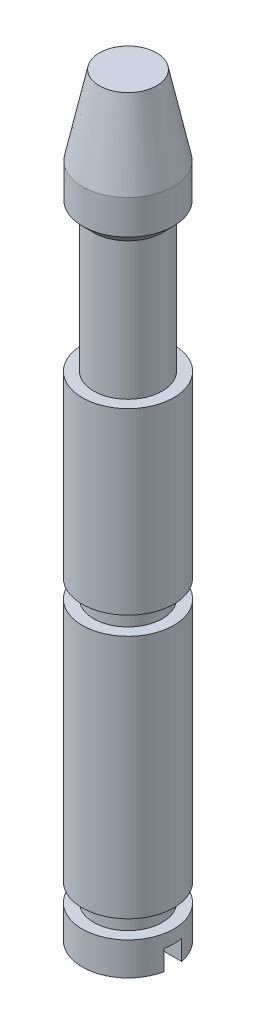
ISO-10303-21;
HEADER;
FILE_DESCRIPTION(('STEP AP214'),'2;1');
FILE_NAME('part.step','',(''),(''),'','','');
FILE_SCHEMA(('AUTOMOTIVE_DESIGN { 1 0 10303 214 1 1 1 1 }'));
ENDSEC;
DATA;
#1=APPLICATION_CONTEXT('core data for automotive mechanical design processes');
#2=APPLICATION_PROTOCOL_DEFINITION('international standard','automotive_design',2000,#1);
#3=PRODUCT_CONTEXT('',#1,'mechanical');
#4=PRODUCT('Part','Part','',(#3));
#5=PRODUCT_RELATED_PRODUCT_CATEGORY('part','',(#4));
#6=PRODUCT_DEFINITION_FORMATION('','',#4);
#7=PRODUCT_DEFINITION_CONTEXT('part definition',#1,'design');
#8=PRODUCT_DEFINITION('design','',#6,#7);
#9=PRODUCT_DEFINITION_SHAPE('','',#8);
#10=(LENGTH_UNIT() NAMED_UNIT(*) SI_UNIT(.MILLI.,.METRE.));
#11=(NAMED_UNIT(*) PLANE_ANGLE_UNIT() SI_UNIT($,.RADIAN.));
#12=(NAMED_UNIT(*) SI_UNIT($,.STERADIAN.) SOLID_ANGLE_UNIT());
#13=UNCERTAINTY_MEASURE_WITH_UNIT(LENGTH_MEASURE(1.E-05),#10,'distance_accuracy_value','');
#14=(GEOMETRIC_REPRESENTATION_CONTEXT(3) GLOBAL_UNCERTAINTY_ASSIGNED_CONTEXT((#13)) GLOBAL_UNIT_ASSIGNED_CONTEXT((#10,
#11,#12)) REPRESENTATION_CONTEXT('',''));
#15=CARTESIAN_POINT('',(0.,0.,0.));
#16=DIRECTION('',(0.,0.,1.));
#17=DIRECTION('',(1.,0.,0.));
#18=AXIS2_PLACEMENT_3D('',#15,#16,#17);
#19=CARTESIAN_POINT('',(3.175,0.,0.));
#20=DIRECTION('',(0.,-1.,0.));
#21=DIRECTION('',(0.,0.,-1.));
#22=AXIS2_PLACEMENT_3D('',#19,#20,#21);
#23=PLANE('',#22);
#24=DIRECTION('',(-1.,0.,0.));
#25=VECTOR('',#24,1.);
#26=CARTESIAN_POINT('',(3.175,0.,0.6096));
#27=LINE('',#26,#25);
#28=CARTESIAN_POINT('',(3.11592888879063,0.,0.6096));
#29=VERTEX_POINT('',#28);
#30=CARTESIAN_POINT('',(-3.11592888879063,0.,0.6096));
#31=VERTEX_POINT('',#30);
#32=EDGE_CURVE('E88',#29,#31,#27,.T.);
#33=ORIENTED_EDGE('',*,*,#32,.F.);
#34=CARTESIAN_POINT('',(0.,0.,0.));
#35=DIRECTION('',(0.,-1.,0.));
#36=DIRECTION('',(0.,0.,-1.));
#37=AXIS2_PLACEMENT_3D('',#34,#35,#36);
#38=CIRCLE('',#37,3.175);
#39=EDGE_CURVE('E100',#29,#31,#38,.T.);
#40=ORIENTED_EDGE('',*,*,#39,.T.);
#41=EDGE_LOOP('',(#33,#40));
#42=FACE_BOUND('',#41,.T.);
#43=ADVANCED_FACE('F40',(#42),#23,.T.);
#44=CARTESIAN_POINT('',(0.,52.3875,0.));
#45=DIRECTION('',(0.,1.,0.));
#46=DIRECTION('',(0.,0.,1.));
#47=AXIS2_PLACEMENT_3D('',#44,#45,#46);
#48=PLANE('',#47);
#49=CARTESIAN_POINT('',(0.,52.3875,0.));
#50=DIRECTION('',(0.,-1.,0.));
#51=DIRECTION('',(0.,0.,-1.));
#52=AXIS2_PLACEMENT_3D('',#49,#50,#51);
#53=CIRCLE('',#52,1.984375);
#54=CARTESIAN_POINT('',(0.,52.3875,-1.984375));
#55=VERTEX_POINT('',#54);
#56=EDGE_CURVE('E89',#55,#55,#53,.T.);
#57=ORIENTED_EDGE('',*,*,#56,.F.);
#58=EDGE_LOOP('',(#57));
#59=FACE_BOUND('',#58,.T.);
#60=ADVANCED_FACE('F42',(#59),#48,.T.);
#61=CARTESIAN_POINT('',(0.,46.9055473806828,0.));
#62=DIRECTION('',(0.,-1.,0.));
#63=DIRECTION('',(0.,0.,-1.));
#64=AXIS2_PLACEMENT_3D('',#61,#62,#63);
#65=CONICAL_SURFACE('',#64,3.1496,0.209439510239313);
#66=ORIENTED_EDGE('',*,*,#56,.T.);
#67=EDGE_LOOP('',(#66));
#68=FACE_BOUND('',#67,.T.);
#69=CARTESIAN_POINT('',(0.,46.9055473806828,0.));
#70=DIRECTION('',(0.,-1.,0.));
#71=DIRECTION('',(0.,0.,-1.));
#72=AXIS2_PLACEMENT_3D('',#69,#70,#71);
#73=CIRCLE('',#72,3.1496);
#74=CARTESIAN_POINT('',(0.,46.9055473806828,-3.1496));
#75=VERTEX_POINT('',#74);
#76=EDGE_CURVE('E142',#75,#75,#73,.T.);
#77=ORIENTED_EDGE('',*,*,#76,.F.);
#78=EDGE_LOOP('',(#77));
#79=FACE_BOUND('',#78,.T.);
#80=ADVANCED_FACE('F155',(#68,#79),#65,.T.);
#81=CARTESIAN_POINT('',(0.,52.3875,0.));
#82=DIRECTION('',(0.,-1.,0.));
#83=DIRECTION('',(0.,0.,-1.));
#84=AXIS2_PLACEMENT_3D('',#81,#82,#83);
#85=CYLINDRICAL_SURFACE('',#84,3.1496);
#86=ORIENTED_EDGE('',*,*,#76,.T.);
#87=EDGE_LOOP('',(#86));
#88=FACE_BOUND('',#87,.T.);
#89=CARTESIAN_POINT('',(0.,44.5242973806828,0.));
#90=DIRECTION('',(0.,-1.,0.));
#91=DIRECTION('',(0.,0.,-1.));
#92=AXIS2_PLACEMENT_3D('',#89,#90,#91);
#93=CIRCLE('',#92,3.1496);
#94=CARTESIAN_POINT('',(0.,44.5242973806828,-3.1496));
#95=VERTEX_POINT('',#94);
#96=EDGE_CURVE('E139',#95,#95,#93,.T.);
#97=ORIENTED_EDGE('',*,*,#96,.F.);
#98=EDGE_LOOP('',(#97));
#99=FACE_BOUND('',#98,.T.);
#100=ADVANCED_FACE('F211',(#88,#99),#85,.T.);
#101=CARTESIAN_POINT('',(0.,43.7559473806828,0.));
#102=DIRECTION('',(0.,1.,0.));
#103=DIRECTION('',(0.,0.,1.));
#104=AXIS2_PLACEMENT_3D('',#101,#102,#103);
#105=CONICAL_SURFACE('',#104,2.38125,0.785398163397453);
#106=ORIENTED_EDGE('',*,*,#96,.T.);
#107=EDGE_LOOP('',(#106));
#108=FACE_BOUND('',#107,.T.);
#109=CARTESIAN_POINT('',(0.,43.7559473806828,0.));
#110=DIRECTION('',(0.,-1.,0.));
#111=DIRECTION('',(0.,0.,-1.));
#112=AXIS2_PLACEMENT_3D('',#109,#110,#111);
#113=CIRCLE('',#112,2.38125);
#114=CARTESIAN_POINT('',(0.,43.7559473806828,-2.38125));
#115=VERTEX_POINT('',#114);
#116=EDGE_CURVE('E136',#115,#115,#113,.T.);
#117=ORIENTED_EDGE('',*,*,#116,.F.);
#118=EDGE_LOOP('',(#117));
#119=FACE_BOUND('',#118,.T.);
#120=ADVANCED_FACE('F207',(#108,#119),#105,.T.);
#121=CARTESIAN_POINT('',(0.,52.3875,0.));
#122=DIRECTION('',(0.,-1.,0.));
#123=DIRECTION('',(0.,0.,-1.));
#124=AXIS2_PLACEMENT_3D('',#121,#122,#123);
#125=CYLINDRICAL_SURFACE('',#124,2.38125);
#126=ORIENTED_EDGE('',*,*,#116,.T.);
#127=EDGE_LOOP('',(#126));
#128=FACE_BOUND('',#127,.T.);
#129=CARTESIAN_POINT('',(0.,34.2309473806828,0.));
#130=DIRECTION('',(0.,-1.,0.));
#131=DIRECTION('',(0.,0.,-1.));
#132=AXIS2_PLACEMENT_3D('',#129,#130,#131);
#133=CIRCLE('',#132,2.38125);
#134=CARTESIAN_POINT('',(0.,34.2309473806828,-2.38125));
#135=VERTEX_POINT('',#134);
#136=EDGE_CURVE('E133',#135,#135,#133,.T.);
#137=ORIENTED_EDGE('',*,*,#136,.F.);
#138=EDGE_LOOP('',(#137));
#139=FACE_BOUND('',#138,.T.);
#140=ADVANCED_FACE('F203',(#128,#139),#125,.T.);
#141=CARTESIAN_POINT('',(2.38125,34.2309473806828,0.));
#142=DIRECTION('',(0.,1.,0.));
#143=DIRECTION('',(0.,0.,1.));
#144=AXIS2_PLACEMENT_3D('',#141,#142,#143);
#145=PLANE('',#144);
#146=ORIENTED_EDGE('',*,*,#136,.T.);
#147=EDGE_LOOP('',(#146));
#148=FACE_BOUND('',#147,.T.);
#149=CARTESIAN_POINT('',(0.,34.2309473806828,0.));
#150=DIRECTION('',(0.,-1.,0.));
#151=DIRECTION('',(0.,0.,-1.));
#152=AXIS2_PLACEMENT_3D('',#149,#150,#151);
#153=CIRCLE('',#152,3.175);
#154=CARTESIAN_POINT('',(0.,34.2309473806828,-3.175));
#155=VERTEX_POINT('',#154);
#156=EDGE_CURVE('E130',#155,#155,#153,.T.);
#157=ORIENTED_EDGE('',*,*,#156,.F.);
#158=EDGE_LOOP('',(#157));
#159=FACE_BOUND('',#158,.T.);
#160=ADVANCED_FACE('F199',(#148,#159),#145,.T.);
#161=CARTESIAN_POINT('',(0.,52.3875,0.));
#162=DIRECTION('',(0.,-1.,0.));
#163=DIRECTION('',(0.,0.,-1.));
#164=AXIS2_PLACEMENT_3D('',#161,#162,#163);
#165=CYLINDRICAL_SURFACE('',#164,3.175);
#166=ORIENTED_EDGE('',*,*,#156,.T.);
#167=EDGE_LOOP('',(#166));
#168=FACE_BOUND('',#167,.T.);
#169=CARTESIAN_POINT('',(0.,21.81225,0.));
#170=DIRECTION('',(0.,-1.,0.));
#171=DIRECTION('',(0.,0.,-1.));
#172=AXIS2_PLACEMENT_3D('',#169,#170,#171);
#173=CIRCLE('',#172,3.175);
#174=CARTESIAN_POINT('',(0.,21.81225,-3.175));
#175=VERTEX_POINT('',#174);
#176=EDGE_CURVE('E127',#175,#175,#173,.T.);
#177=ORIENTED_EDGE('',*,*,#176,.F.);
#178=EDGE_LOOP('',(#177));
#179=FACE_BOUND('',#178,.T.);
#180=ADVANCED_FACE('F195',(#168,#179),#165,.T.);
#181=CARTESIAN_POINT('',(3.175,21.81225,0.));
#182=DIRECTION('',(0.,-1.,0.));
#183=DIRECTION('',(0.,0.,-1.));
#184=AXIS2_PLACEMENT_3D('',#181,#182,#183);
#185=PLANE('',#184);
#186=ORIENTED_EDGE('',*,*,#176,.T.);
#187=EDGE_LOOP('',(#186));
#188=FACE_BOUND('',#187,.T.);
#189=CARTESIAN_POINT('',(0.,21.81225,0.));
#190=DIRECTION('',(0.,-1.,0.));
#191=DIRECTION('',(0.,0.,-1.));
#192=AXIS2_PLACEMENT_3D('',#189,#190,#191);
#193=CIRCLE('',#192,2.38125);
#194=CARTESIAN_POINT('',(0.,21.81225,-2.38125));
#195=VERTEX_POINT('',#194);
#196=EDGE_CURVE('E124',#195,#195,#193,.T.);
#197=ORIENTED_EDGE('',*,*,#196,.F.);
#198=EDGE_LOOP('',(#197));
#199=FACE_BOUND('',#198,.T.);
#200=ADVANCED_FACE('F191',(#188,#199),#185,.T.);
#201=CARTESIAN_POINT('',(0.,52.3875,0.));
#202=DIRECTION('',(0.,-1.,0.));
#203=DIRECTION('',(0.,0.,-1.));
#204=AXIS2_PLACEMENT_3D('',#201,#202,#203);
#205=CYLINDRICAL_SURFACE('',#204,2.38125);
#206=ORIENTED_EDGE('',*,*,#196,.T.);
#207=EDGE_LOOP('',(#206));
#208=FACE_BOUND('',#207,.T.);
#209=CARTESIAN_POINT('',(0.,20.54225,0.));
#210=DIRECTION('',(0.,-1.,0.));
#211=DIRECTION('',(0.,0.,-1.));
#212=AXIS2_PLACEMENT_3D('',#209,#210,#211);
#213=CIRCLE('',#212,2.38125);
#214=CARTESIAN_POINT('',(0.,20.54225,-2.38125));
#215=VERTEX_POINT('',#214);
#216=EDGE_CURVE('E121',#215,#215,#213,.T.);
#217=ORIENTED_EDGE('',*,*,#216,.F.);
#218=EDGE_LOOP('',(#217));
#219=FACE_BOUND('',#218,.T.);
#220=ADVANCED_FACE('F187',(#208,#219),#205,.T.);
#221=CARTESIAN_POINT('',(3.175,20.54225,0.));
#222=DIRECTION('',(0.,1.,0.));
#223=DIRECTION('',(0.,0.,1.));
#224=AXIS2_PLACEMENT_3D('',#221,#222,#223);
#225=PLANE('',#224);
#226=ORIENTED_EDGE('',*,*,#216,.T.);
#227=EDGE_LOOP('',(#226));
#228=FACE_BOUND('',#227,.T.);
#229=CARTESIAN_POINT('',(0.,20.54225,0.));
#230=DIRECTION('',(0.,-1.,0.));
#231=DIRECTION('',(0.,0.,-1.));
#232=AXIS2_PLACEMENT_3D('',#229,#230,#231);
#233=CIRCLE('',#232,3.175);
#234=CARTESIAN_POINT('',(0.,20.54225,-3.175));
#235=VERTEX_POINT('',#234);
#236=EDGE_CURVE('E118',#235,#235,#233,.T.);
#237=ORIENTED_EDGE('',*,*,#236,.F.);
#238=EDGE_LOOP('',(#237));
#239=FACE_BOUND('',#238,.T.);
#240=ADVANCED_FACE('F183',(#228,#239),#225,.T.);
#241=CARTESIAN_POINT('',(0.,52.3875,0.));
#242=DIRECTION('',(0.,-1.,0.));
#243=DIRECTION('',(0.,0.,-1.));
#244=AXIS2_PLACEMENT_3D('',#241,#242,#243);
#245=CYLINDRICAL_SURFACE('',#244,3.175);
#246=ORIENTED_EDGE('',*,*,#236,.T.);
#247=EDGE_LOOP('',(#246));
#248=FACE_BOUND('',#247,.T.);
#249=CARTESIAN_POINT('',(0.,3.556,0.));
#250=DIRECTION('',(0.,-1.,0.));
#251=DIRECTION('',(0.,0.,-1.));
#252=AXIS2_PLACEMENT_3D('',#249,#250,#251);
#253=CIRCLE('',#252,3.175);
#254=CARTESIAN_POINT('',(0.,3.556,-3.175));
#255=VERTEX_POINT('',#254);
#256=EDGE_CURVE('E115',#255,#255,#253,.T.);
#257=ORIENTED_EDGE('',*,*,#256,.F.);
#258=EDGE_LOOP('',(#257));
#259=FACE_BOUND('',#258,.T.);
#260=ADVANCED_FACE('F179',(#248,#259),#245,.T.);
#261=CARTESIAN_POINT('',(3.175,3.556,0.));
#262=DIRECTION('',(0.,-1.,0.));
#263=DIRECTION('',(0.,0.,-1.));
#264=AXIS2_PLACEMENT_3D('',#261,#262,#263);
#265=PLANE('',#264);
#266=ORIENTED_EDGE('',*,*,#256,.T.);
#267=EDGE_LOOP('',(#266));
#268=FACE_BOUND('',#267,.T.);
#269=CARTESIAN_POINT('',(0.,3.556,0.));
#270=DIRECTION('',(0.,-1.,0.));
#271=DIRECTION('',(0.,0.,-1.));
#272=AXIS2_PLACEMENT_3D('',#269,#270,#271);
#273=CIRCLE('',#272,2.38125);
#274=CARTESIAN_POINT('',(0.,3.556,-2.38125));
#275=VERTEX_POINT('',#274);
#276=EDGE_CURVE('E112',#275,#275,#273,.T.);
#277=ORIENTED_EDGE('',*,*,#276,.F.);
#278=EDGE_LOOP('',(#277));
#279=FACE_BOUND('',#278,.T.);
#280=ADVANCED_FACE('F175',(#268,#279),#265,.T.);
#281=CARTESIAN_POINT('',(0.,52.3875,0.));
#282=DIRECTION('',(0.,-1.,0.));
#283=DIRECTION('',(0.,0.,-1.));
#284=AXIS2_PLACEMENT_3D('',#281,#282,#283);
#285=CYLINDRICAL_SURFACE('',#284,2.38125);
#286=ORIENTED_EDGE('',*,*,#276,.T.);
#287=EDGE_LOOP('',(#286));
#288=FACE_BOUND('',#287,.T.);
#289=CARTESIAN_POINT('',(0.,2.286,0.));
#290=DIRECTION('',(0.,-1.,0.));
#291=DIRECTION('',(0.,0.,-1.));
#292=AXIS2_PLACEMENT_3D('',#289,#290,#291);
#293=CIRCLE('',#292,2.38125);
#294=CARTESIAN_POINT('',(0.,2.286,-2.38125));
#295=VERTEX_POINT('',#294);
#296=EDGE_CURVE('E109',#295,#295,#293,.T.);
#297=ORIENTED_EDGE('',*,*,#296,.F.);
#298=EDGE_LOOP('',(#297));
#299=FACE_BOUND('',#298,.T.);
#300=ADVANCED_FACE('F169',(#288,#299),#285,.T.);
#301=CARTESIAN_POINT('',(3.175,2.286,0.));
#302=DIRECTION('',(0.,1.,0.));
#303=DIRECTION('',(0.,0.,1.));
#304=AXIS2_PLACEMENT_3D('',#301,#302,#303);
#305=PLANE('',#304);
#306=ORIENTED_EDGE('',*,*,#296,.T.);
#307=EDGE_LOOP('',(#306));
#308=FACE_BOUND('',#307,.T.);
#309=CARTESIAN_POINT('',(0.,2.286,0.));
#310=DIRECTION('',(0.,-1.,0.));
#311=DIRECTION('',(0.,0.,-1.));
#312=AXIS2_PLACEMENT_3D('',#309,#310,#311);
#313=CIRCLE('',#312,3.175);
#314=CARTESIAN_POINT('',(0.,2.286,-3.175));
#315=VERTEX_POINT('',#314);
#316=EDGE_CURVE('E103',#315,#315,#313,.T.);
#317=ORIENTED_EDGE('',*,*,#316,.F.);
#318=EDGE_LOOP('',(#317));
#319=FACE_BOUND('',#318,.T.);
#320=ADVANCED_FACE('F165',(#308,#319),#305,.T.);
#321=CARTESIAN_POINT('',(0.,52.3875,0.));
#322=DIRECTION('',(0.,-1.,0.));
#323=DIRECTION('',(0.,0.,-1.));
#324=AXIS2_PLACEMENT_3D('',#321,#322,#323);
#325=CYLINDRICAL_SURFACE('',#324,3.175);
#326=DIRECTION('',(0.,-1.,0.));
#327=VECTOR('',#326,1.);
#328=CARTESIAN_POINT('',(-3.11592888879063,52.3875,0.6096));
#329=LINE('',#328,#327);
#330=CARTESIAN_POINT('',(-3.11592888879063,1.397,0.6096));
#331=VERTEX_POINT('',#330);
#332=EDGE_CURVE('E63',#31,#331,#329,.F.);
#333=ORIENTED_EDGE('',*,*,#332,.F.);
#334=ORIENTED_EDGE('',*,*,#39,.F.);
#335=DIRECTION('',(0.,-1.,0.));
#336=VECTOR('',#335,1.);
#337=CARTESIAN_POINT('',(3.11592888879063,52.3875,0.6096));
#338=LINE('',#337,#336);
#339=CARTESIAN_POINT('',(3.11592888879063,1.397,0.6096));
#340=VERTEX_POINT('',#339);
#341=EDGE_CURVE('E97',#340,#29,#338,.T.);
#342=ORIENTED_EDGE('',*,*,#341,.F.);
#343=CARTESIAN_POINT('',(0.,1.397,0.));
#344=DIRECTION('',(0.,-1.,0.));
#345=DIRECTION('',(0.,0.,-1.));
#346=AXIS2_PLACEMENT_3D('',#343,#344,#345);
#347=CIRCLE('',#346,3.175);
#348=CARTESIAN_POINT('',(3.11592888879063,1.397,-0.6096));
#349=VERTEX_POINT('',#348);
#350=EDGE_CURVE('E44',#340,#349,#347,.F.);
#351=ORIENTED_EDGE('',*,*,#350,.T.);
#352=DIRECTION('',(0.,-1.,0.));
#353=VECTOR('',#352,1.);
#354=CARTESIAN_POINT('',(3.11592888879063,52.3875,-0.6096));
#355=LINE('',#354,#353);
#356=CARTESIAN_POINT('',(3.11592888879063,0.,-0.6096));
#357=VERTEX_POINT('',#356);
#358=EDGE_CURVE('E83',#357,#349,#355,.F.);
#359=ORIENTED_EDGE('',*,*,#358,.F.);
#360=CARTESIAN_POINT('',(-3.11592888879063,0.,-0.6096));
#361=VERTEX_POINT('',#360);
#362=EDGE_CURVE('E95',#361,#357,#38,.T.);
#363=ORIENTED_EDGE('',*,*,#362,.F.);
#364=DIRECTION('',(0.,-1.,0.));
#365=VECTOR('',#364,1.);
#366=CARTESIAN_POINT('',(-3.11592888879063,52.3875,-0.6096));
#367=LINE('',#366,#365);
#368=CARTESIAN_POINT('',(-3.11592888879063,1.397,-0.6096));
#369=VERTEX_POINT('',#368);
#370=EDGE_CURVE('E55',#369,#361,#367,.T.);
#371=ORIENTED_EDGE('',*,*,#370,.F.);
#372=EDGE_CURVE('E12',#369,#331,#347,.F.);
#373=ORIENTED_EDGE('',*,*,#372,.T.);
#374=EDGE_LOOP('',(#333,#334,#342,#351,#359,#363,#371,#373));
#375=FACE_BOUND('',#374,.T.);
#376=ORIENTED_EDGE('',*,*,#316,.T.);
#377=EDGE_LOOP('',(#376));
#378=FACE_BOUND('',#377,.T.);
#379=ADVANCED_FACE('F93',(#375,#378),#325,.T.);
#380=DIRECTION('',(1.,0.,0.));
#381=VECTOR('',#380,1.);
#382=CARTESIAN_POINT('',(3.175,0.,-0.6096));
#383=LINE('',#382,#381);
#384=EDGE_CURVE('E80',#361,#357,#383,.T.);
#385=ORIENTED_EDGE('',*,*,#384,.F.);
#386=ORIENTED_EDGE('',*,*,#362,.T.);
#387=EDGE_LOOP('',(#385,#386));
#388=FACE_BOUND('',#387,.T.);
#389=ADVANCED_FACE('F99',(#388),#23,.T.);
#390=CARTESIAN_POINT('',(-3.175,1.397,0.6096));
#391=DIRECTION('',(0.,0.,1.));
#392=DIRECTION('',(1.,0.,0.));
#393=AXIS2_PLACEMENT_3D('',#390,#391,#392);
#394=PLANE('',#393);
#395=ORIENTED_EDGE('',*,*,#332,.T.);
#396=DIRECTION('',(-1.,0.,0.));
#397=VECTOR('',#396,1.);
#398=CARTESIAN_POINT('',(-3.175,1.397,0.6096));
#399=LINE('',#398,#397);
#400=EDGE_CURVE('E337',#340,#331,#399,.T.);
#401=ORIENTED_EDGE('',*,*,#400,.F.);
#402=ORIENTED_EDGE('',*,*,#341,.T.);
#403=ORIENTED_EDGE('',*,*,#32,.T.);
#404=EDGE_LOOP('',(#395,#401,#402,#403));
#405=FACE_BOUND('',#404,.T.);
#406=ADVANCED_FACE('F147',(#405),#394,.F.);
#407=CARTESIAN_POINT('',(-3.175,1.397,-0.6096));
#408=DIRECTION('',(0.,0.,-1.));
#409=DIRECTION('',(-1.,0.,0.));
#410=AXIS2_PLACEMENT_3D('',#407,#408,#409);
#411=PLANE('',#410);
#412=ORIENTED_EDGE('',*,*,#358,.T.);
#413=DIRECTION('',(1.,0.,0.));
#414=VECTOR('',#413,1.);
#415=CARTESIAN_POINT('',(-3.175,1.397,-0.6096));
#416=LINE('',#415,#414);
#417=EDGE_CURVE('E336',#369,#349,#416,.T.);
#418=ORIENTED_EDGE('',*,*,#417,.F.);
#419=ORIENTED_EDGE('',*,*,#370,.T.);
#420=ORIENTED_EDGE('',*,*,#384,.T.);
#421=EDGE_LOOP('',(#412,#418,#419,#420));
#422=FACE_BOUND('',#421,.T.);
#423=ADVANCED_FACE('F82',(#422),#411,.F.);
#424=CARTESIAN_POINT('',(-3.175,1.397,-0.6096));
#425=DIRECTION('',(0.,-1.,0.));
#426=DIRECTION('',(0.,0.,-1.));
#427=AXIS2_PLACEMENT_3D('',#424,#425,#426);
#428=PLANE('',#427);
#429=ORIENTED_EDGE('',*,*,#417,.T.);
#430=ORIENTED_EDGE('',*,*,#350,.F.);
#431=ORIENTED_EDGE('',*,*,#400,.T.);
#432=ORIENTED_EDGE('',*,*,#372,.F.);
#433=EDGE_LOOP('',(#429,#430,#431,#432));
#434=FACE_BOUND('',#433,.T.);
#435=ADVANCED_FACE('F324',(#434),#428,.T.);
#436=CLOSED_SHELL('',(#43,#60,#80,#100,#120,#140,#160,#180,#200,#220,#240,#260,#280,#300,#320,
#379,#389,#406,#423,#435));
#437=MANIFOLD_SOLID_BREP('B2',#436);
#438=ADVANCED_BREP_SHAPE_REPRESENTATION('',(#18,#437),#14);
#439=SHAPE_DEFINITION_REPRESENTATION(#9,#438);
ENDSEC;
END-ISO-10303-21;
